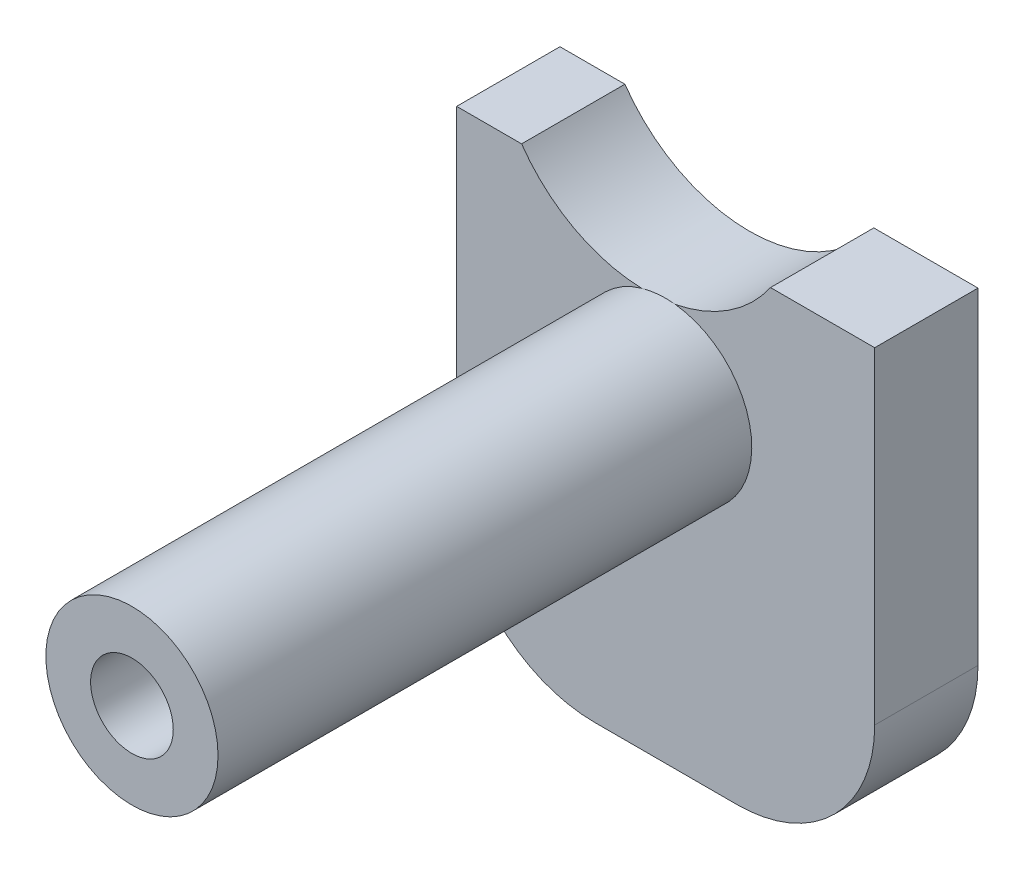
from build123d import *

# Parameters (mm, degrees)
ESQUISSE1_R      = 1.2
EXTRUSION1_DEPTH = 3
ESQUISSE2_R      = 2.5
ESQUISSE2_R_2    = 1.2
EXTRUSION2_DEPTH = 15.5


with BuildPart() as part:
    # Esquisse1 → Extrusion1 (new body)
    with BuildSketch(Plane.XY):
        with BuildLine():
            Line((-26.5, -20.592093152), (-22.36, -20.592093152))
            ThreePointArc((-22.36, -20.592093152), (-19.531572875, -19.420520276), (-18.36, -16.592093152))
            Line((-18.36, -16.592093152), (-18.36, -7.101796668))
            Line((-18.36, -7.101796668), (-21.385945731, -7.101796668))
            ThreePointArc((-21.385945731, -7.101796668), (-25, -8.992093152), (-28.614054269, -7.101796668))
            Line((-28.614054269, -7.101796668), (-30.5, -7.101796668))
            Line((-30.5, -7.101796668), (-30.5, -16.592093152))
            ThreePointArc((-30.5, -16.592093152), (-29.328427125, -19.420520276), (-26.5, -20.592093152))
        make_face()
        with Locations((-24.43, -11.392093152)):
            Circle(ESQUISSE1_R, mode=Mode.SUBTRACT)
    extrude(amount=EXTRUSION1_DEPTH)

    # Esquisse2 → Extrusion2 (add)
    with BuildSketch(Plane.XY.offset(3)):
        with Locations(Location((-24.43, -11.392093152, 0), (0, 0, 106.116584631))):
            Circle(ESQUISSE2_R)
        with Locations((-24.43, -11.392093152)):
            Circle(ESQUISSE2_R_2, mode=Mode.SUBTRACT)
    extrude(amount=EXTRUSION2_DEPTH)


solid = part.part
